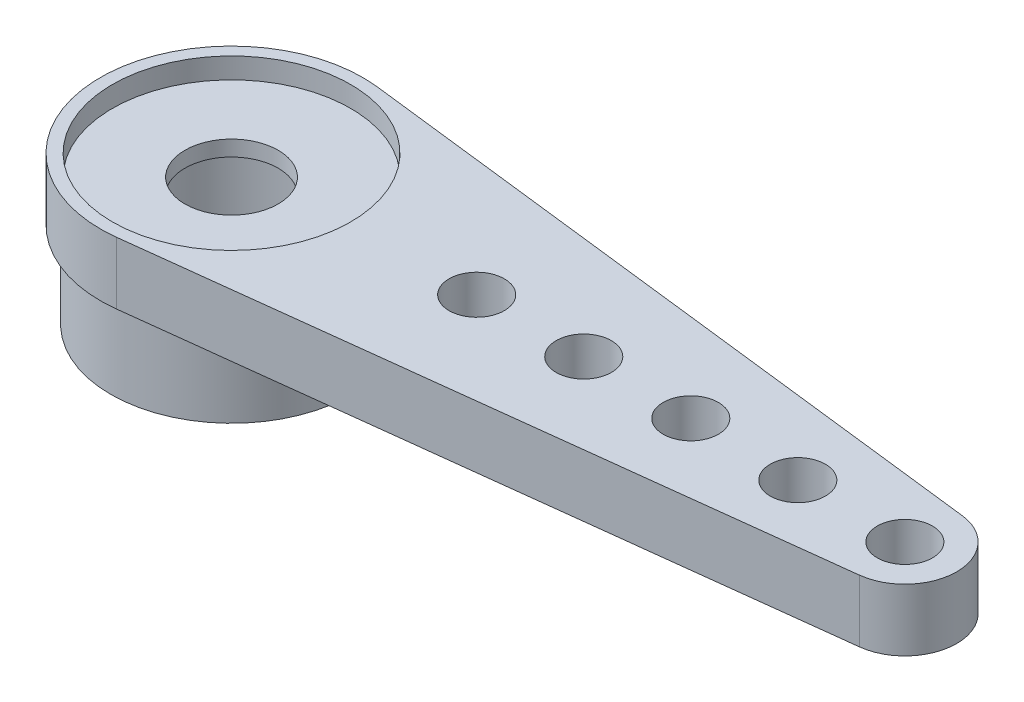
from build123d import *

# Parameters (mm, degrees)
ESQUISSE1_R             = 1.35
ESQUISSE1_R_2           = 0.8
BOSS_EXTRU_1_DEPTH      = 1.8
ESQUISSE2_R             = 3.5
BOSS_EXTRU_2_DEPTH      = 2.5
ESQUISSE3_R             = 2.5
ENL_V_MAT_EXTRU_1_DEPTH = 3.25
ESQUISSE4_R             = 3.45
ENL_V_MAT_EXTRU_2_DEPTH = 0.6


with BuildPart() as part:
    # Esquisse1 → Boss.-Extru.1 (new body)
    with BuildSketch(Plane(origin=(0, 0, 0), x_dir=(1, 0, 0), z_dir=(0, 1, 0))):
        with BuildLine():
            Line((0.448205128, 3.773474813), (19.676923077, 1.489529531))
            ThreePointArc((19.676923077, 1.489529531), (21, 0), (19.676923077, -1.489529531))
            Line((19.676923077, -1.489529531), (0.448205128, -3.773474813))
            ThreePointArc((0.448205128, -3.773474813), (-3.8, 0), (0.448205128, 3.773474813))
        make_face()
        with Locations(Location((0, 0, 0), (0, 0, 270))):
            Circle(ESQUISSE1_R, mode=Mode.SUBTRACT)
        with Locations(Location((19.5, 0, 0), (0, 0, 270))):
            Circle(ESQUISSE1_R_2, mode=Mode.SUBTRACT)
        with Locations(Location((7.1, 0, 0), (0, 0, 270))):
            Circle(ESQUISSE1_R_2, mode=Mode.SUBTRACT)
        with Locations(Location((10.2, 0, 0), (0, 0, 270))):
            Circle(ESQUISSE1_R_2, mode=Mode.SUBTRACT)
        with Locations(Location((13.3, 0, 0), (0, 0, 270))):
            Circle(ESQUISSE1_R_2, mode=Mode.SUBTRACT)
        with Locations(Location((16.4, 0, 0), (0, 0, 270))):
            Circle(ESQUISSE1_R_2, mode=Mode.SUBTRACT)
    extrude(amount=BOSS_EXTRU_1_DEPTH)

    # Esquisse2 → Boss.-Extru.2 (add)
    with BuildSketch(Plane.XZ):
        with Locations(Location((0, 0, 0), (0, 0, 90))):
            Circle(ESQUISSE2_R)
    extrude(amount=BOSS_EXTRU_2_DEPTH)

    # Esquisse3 → Enl_v. mat.-Extru.1 (cut)
    with BuildSketch(Plane.XZ.offset(2.5)):
        with Locations(Location((0, 0, 0), (0, 0, 270))):
            Circle(ESQUISSE3_R)
    extrude(amount=-ENL_V_MAT_EXTRU_1_DEPTH, mode=Mode.SUBTRACT)

    # Esquisse4 → Enl_v. mat.-Extru.2 (cut)
    with BuildSketch(Plane(origin=(0, 1.8, 0), x_dir=(1, 0, 0), z_dir=(0, 1, 0))):
        with Locations(Location((0, 0, 0), (0, 0, 270))):
            Circle(ESQUISSE4_R)
    extrude(amount=-ENL_V_MAT_EXTRU_2_DEPTH, mode=Mode.SUBTRACT)


solid = part.part
